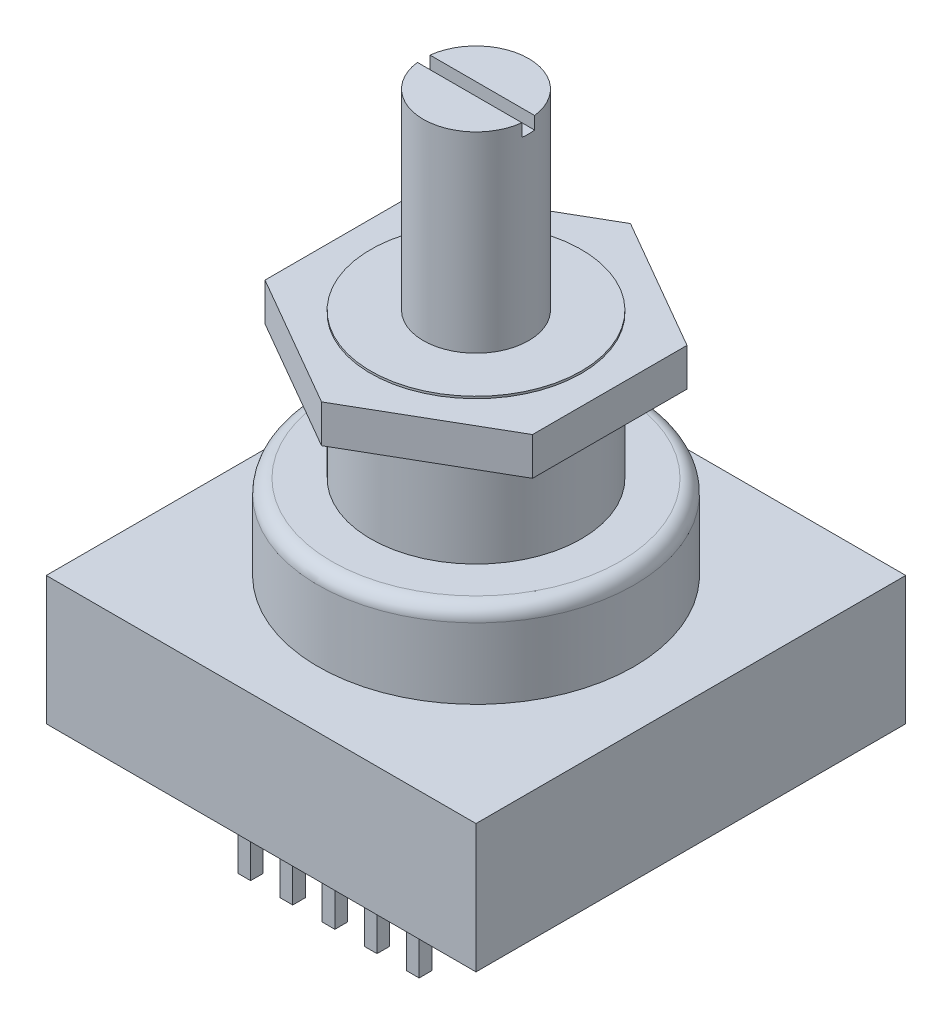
ISO-10303-21;
HEADER;
FILE_DESCRIPTION(('STEP AP214'),'2;1');
FILE_NAME('part.step','',(''),(''),'','','');
FILE_SCHEMA(('AUTOMOTIVE_DESIGN { 1 0 10303 214 1 1 1 1 }'));
ENDSEC;
DATA;
#1=APPLICATION_CONTEXT('core data for automotive mechanical design processes');
#2=APPLICATION_PROTOCOL_DEFINITION('international standard','automotive_design',2000,#1);
#3=PRODUCT_CONTEXT('',#1,'mechanical');
#4=PRODUCT('Part','Part','',(#3));
#5=PRODUCT_RELATED_PRODUCT_CATEGORY('part','',(#4));
#6=PRODUCT_DEFINITION_FORMATION('','',#4);
#7=PRODUCT_DEFINITION_CONTEXT('part definition',#1,'design');
#8=PRODUCT_DEFINITION('design','',#6,#7);
#9=PRODUCT_DEFINITION_SHAPE('','',#8);
#10=(LENGTH_UNIT() NAMED_UNIT(*) SI_UNIT(.MILLI.,.METRE.));
#11=(NAMED_UNIT(*) PLANE_ANGLE_UNIT() SI_UNIT($,.RADIAN.));
#12=(NAMED_UNIT(*) SI_UNIT($,.STERADIAN.) SOLID_ANGLE_UNIT());
#13=UNCERTAINTY_MEASURE_WITH_UNIT(LENGTH_MEASURE(1.E-05),#10,'distance_accuracy_value','');
#14=(GEOMETRIC_REPRESENTATION_CONTEXT(3) GLOBAL_UNCERTAINTY_ASSIGNED_CONTEXT((#13)) GLOBAL_UNIT_ASSIGNED_CONTEXT((#10,
#11,#12)) REPRESENTATION_CONTEXT('',''));
#15=CARTESIAN_POINT('',(0.,0.,0.));
#16=DIRECTION('',(0.,0.,1.));
#17=DIRECTION('',(1.,0.,0.));
#18=AXIS2_PLACEMENT_3D('',#15,#16,#17);
#19=CARTESIAN_POINT('',(-8.0645,21.463,4.65604124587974));
#20=DIRECTION('',(0.5,0.,-0.866025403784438));
#21=DIRECTION('',(-0.866025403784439,0.,-0.5));
#22=AXIS2_PLACEMENT_3D('',#19,#20,#21);
#23=PLANE('',#22);
#24=DIRECTION('',(0.866025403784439,0.,0.5));
#25=VECTOR('',#24,1.);
#26=CARTESIAN_POINT('',(-8.0645,19.177,4.65604124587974));
#27=LINE('',#26,#25);
#28=CARTESIAN_POINT('',(-8.0645,19.177,4.65604124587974));
#29=VERTEX_POINT('',#28);
#30=CARTESIAN_POINT('',(0.,19.177,9.31208249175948));
#31=VERTEX_POINT('',#30);
#32=EDGE_CURVE('E129',#29,#31,#27,.T.);
#33=ORIENTED_EDGE('',*,*,#32,.T.);
#34=DIRECTION('',(0.,-1.,0.));
#35=VECTOR('',#34,1.);
#36=CARTESIAN_POINT('',(0.,21.463,9.31208249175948));
#37=LINE('',#36,#35);
#38=CARTESIAN_POINT('',(0.,21.463,9.31208249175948));
#39=VERTEX_POINT('',#38);
#40=EDGE_CURVE('E12',#39,#31,#37,.T.);
#41=ORIENTED_EDGE('',*,*,#40,.F.);
#42=DIRECTION('',(0.866025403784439,0.,0.5));
#43=VECTOR('',#42,1.);
#44=CARTESIAN_POINT('',(-8.0645,21.463,4.65604124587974));
#45=LINE('',#44,#43);
#46=CARTESIAN_POINT('',(-8.0645,21.463,4.65604124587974));
#47=VERTEX_POINT('',#46);
#48=EDGE_CURVE('E139',#47,#39,#45,.T.);
#49=ORIENTED_EDGE('',*,*,#48,.F.);
#50=DIRECTION('',(0.,-1.,0.));
#51=VECTOR('',#50,1.);
#52=CARTESIAN_POINT('',(-8.0645,21.463,4.65604124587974));
#53=LINE('',#52,#51);
#54=EDGE_CURVE('E125',#47,#29,#53,.T.);
#55=ORIENTED_EDGE('',*,*,#54,.T.);
#56=EDGE_LOOP('',(#33,#41,#49,#55));
#57=FACE_BOUND('',#56,.T.);
#58=ADVANCED_FACE('F45',(#57),#23,.F.);
#59=CARTESIAN_POINT('',(0.,21.463,9.31208249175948));
#60=DIRECTION('',(-0.5,0.,-0.866025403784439));
#61=DIRECTION('',(-0.866025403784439,0.,0.5));
#62=AXIS2_PLACEMENT_3D('',#59,#60,#61);
#63=PLANE('',#62);
#64=DIRECTION('',(0.866025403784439,0.,-0.5));
#65=VECTOR('',#64,1.);
#66=CARTESIAN_POINT('',(0.,19.177,9.31208249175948));
#67=LINE('',#66,#65);
#68=CARTESIAN_POINT('',(8.0645,19.177,4.65604124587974));
#69=VERTEX_POINT('',#68);
#70=EDGE_CURVE('E132',#31,#69,#67,.T.);
#71=ORIENTED_EDGE('',*,*,#70,.T.);
#72=DIRECTION('',(0.,-1.,0.));
#73=VECTOR('',#72,1.);
#74=CARTESIAN_POINT('',(8.0645,21.463,4.65604124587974));
#75=LINE('',#74,#73);
#76=CARTESIAN_POINT('',(8.0645,21.463,4.65604124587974));
#77=VERTEX_POINT('',#76);
#78=EDGE_CURVE('E53',#77,#69,#75,.T.);
#79=ORIENTED_EDGE('',*,*,#78,.F.);
#80=DIRECTION('',(0.866025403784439,0.,-0.5));
#81=VECTOR('',#80,1.);
#82=CARTESIAN_POINT('',(0.,21.463,9.31208249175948));
#83=LINE('',#82,#81);
#84=EDGE_CURVE('E98',#39,#77,#83,.T.);
#85=ORIENTED_EDGE('',*,*,#84,.F.);
#86=ORIENTED_EDGE('',*,*,#40,.T.);
#87=EDGE_LOOP('',(#71,#79,#85,#86));
#88=FACE_BOUND('',#87,.T.);
#89=ADVANCED_FACE('F163',(#88),#63,.F.);
#90=CARTESIAN_POINT('',(8.0645,21.463,4.65604124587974));
#91=DIRECTION('',(-1.,0.,0.));
#92=DIRECTION('',(0.,-1.,0.));
#93=AXIS2_PLACEMENT_3D('',#90,#91,#92);
#94=PLANE('',#93);
#95=DIRECTION('',(0.,0.,-1.));
#96=VECTOR('',#95,1.);
#97=CARTESIAN_POINT('',(8.0645,19.177,4.65604124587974));
#98=LINE('',#97,#96);
#99=CARTESIAN_POINT('',(8.0645,19.177,-4.65604124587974));
#100=VERTEX_POINT('',#99);
#101=EDGE_CURVE('E134',#69,#100,#98,.T.);
#102=ORIENTED_EDGE('',*,*,#101,.T.);
#103=DIRECTION('',(0.,-1.,0.));
#104=VECTOR('',#103,1.);
#105=CARTESIAN_POINT('',(8.0645,21.463,-4.65604124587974));
#106=LINE('',#105,#104);
#107=CARTESIAN_POINT('',(8.0645,21.463,-4.65604124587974));
#108=VERTEX_POINT('',#107);
#109=EDGE_CURVE('E120',#108,#100,#106,.T.);
#110=ORIENTED_EDGE('',*,*,#109,.F.);
#111=DIRECTION('',(0.,0.,-1.));
#112=VECTOR('',#111,1.);
#113=CARTESIAN_POINT('',(8.0645,21.463,4.65604124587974));
#114=LINE('',#113,#112);
#115=EDGE_CURVE('E111',#77,#108,#114,.T.);
#116=ORIENTED_EDGE('',*,*,#115,.F.);
#117=ORIENTED_EDGE('',*,*,#78,.T.);
#118=EDGE_LOOP('',(#102,#110,#116,#117));
#119=FACE_BOUND('',#118,.T.);
#120=ADVANCED_FACE('F145',(#119),#94,.F.);
#121=CARTESIAN_POINT('',(8.0645,21.463,-4.65604124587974));
#122=DIRECTION('',(-0.5,0.,0.866025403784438));
#123=DIRECTION('',(0.866025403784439,0.,0.5));
#124=AXIS2_PLACEMENT_3D('',#121,#122,#123);
#125=PLANE('',#124);
#126=DIRECTION('',(-0.866025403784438,0.,-0.5));
#127=VECTOR('',#126,1.);
#128=CARTESIAN_POINT('',(8.0645,19.177,-4.65604124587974));
#129=LINE('',#128,#127);
#130=CARTESIAN_POINT('',(0.,19.177,-9.31208249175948));
#131=VERTEX_POINT('',#130);
#132=EDGE_CURVE('E119',#100,#131,#129,.T.);
#133=ORIENTED_EDGE('',*,*,#132,.T.);
#134=DIRECTION('',(0.,-1.,0.));
#135=VECTOR('',#134,1.);
#136=CARTESIAN_POINT('',(0.,21.463,-9.31208249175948));
#137=LINE('',#136,#135);
#138=CARTESIAN_POINT('',(0.,21.463,-9.31208249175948));
#139=VERTEX_POINT('',#138);
#140=EDGE_CURVE('E116',#139,#131,#137,.T.);
#141=ORIENTED_EDGE('',*,*,#140,.F.);
#142=DIRECTION('',(-0.866025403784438,0.,-0.5));
#143=VECTOR('',#142,1.);
#144=CARTESIAN_POINT('',(8.0645,21.463,-4.65604124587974));
#145=LINE('',#144,#143);
#146=EDGE_CURVE('E105',#108,#139,#145,.T.);
#147=ORIENTED_EDGE('',*,*,#146,.F.);
#148=ORIENTED_EDGE('',*,*,#109,.T.);
#149=EDGE_LOOP('',(#133,#141,#147,#148));
#150=FACE_BOUND('',#149,.T.);
#151=ADVANCED_FACE('F117',(#150),#125,.F.);
#152=CARTESIAN_POINT('',(0.,21.463,-9.31208249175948));
#153=DIRECTION('',(0.5,0.,0.866025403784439));
#154=DIRECTION('',(0.866025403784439,0.,-0.5));
#155=AXIS2_PLACEMENT_3D('',#152,#153,#154);
#156=PLANE('',#155);
#157=DIRECTION('',(-0.866025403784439,0.,0.5));
#158=VECTOR('',#157,1.);
#159=CARTESIAN_POINT('',(0.,19.177,-9.31208249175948));
#160=LINE('',#159,#158);
#161=CARTESIAN_POINT('',(-8.0645,19.177,-4.65604124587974));
#162=VERTEX_POINT('',#161);
#163=EDGE_CURVE('E84',#131,#162,#160,.T.);
#164=ORIENTED_EDGE('',*,*,#163,.T.);
#165=DIRECTION('',(0.,-1.,0.));
#166=VECTOR('',#165,1.);
#167=CARTESIAN_POINT('',(-8.0645,21.463,-4.65604124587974));
#168=LINE('',#167,#166);
#169=CARTESIAN_POINT('',(-8.0645,21.463,-4.65604124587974));
#170=VERTEX_POINT('',#169);
#171=EDGE_CURVE('E121',#170,#162,#168,.T.);
#172=ORIENTED_EDGE('',*,*,#171,.F.);
#173=DIRECTION('',(-0.866025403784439,0.,0.5));
#174=VECTOR('',#173,1.);
#175=CARTESIAN_POINT('',(0.,21.463,-9.31208249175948));
#176=LINE('',#175,#174);
#177=EDGE_CURVE('E109',#139,#170,#176,.T.);
#178=ORIENTED_EDGE('',*,*,#177,.F.);
#179=ORIENTED_EDGE('',*,*,#140,.T.);
#180=EDGE_LOOP('',(#164,#172,#178,#179));
#181=FACE_BOUND('',#180,.T.);
#182=ADVANCED_FACE('F123',(#181),#156,.F.);
#183=CARTESIAN_POINT('',(-8.0645,21.463,-4.65604124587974));
#184=DIRECTION('',(1.,0.,0.));
#185=DIRECTION('',(0.,0.,-1.));
#186=AXIS2_PLACEMENT_3D('',#183,#184,#185);
#187=PLANE('',#186);
#188=DIRECTION('',(0.,0.,1.));
#189=VECTOR('',#188,1.);
#190=CARTESIAN_POINT('',(-8.0645,19.177,-4.65604124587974));
#191=LINE('',#190,#189);
#192=EDGE_CURVE('E90',#162,#29,#191,.T.);
#193=ORIENTED_EDGE('',*,*,#192,.T.);
#194=ORIENTED_EDGE('',*,*,#54,.F.);
#195=DIRECTION('',(0.,0.,1.));
#196=VECTOR('',#195,1.);
#197=CARTESIAN_POINT('',(-8.0645,21.463,-4.65604124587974));
#198=LINE('',#197,#196);
#199=EDGE_CURVE('E61',#170,#47,#198,.T.);
#200=ORIENTED_EDGE('',*,*,#199,.F.);
#201=ORIENTED_EDGE('',*,*,#171,.T.);
#202=EDGE_LOOP('',(#193,#194,#200,#201));
#203=FACE_BOUND('',#202,.T.);
#204=ADVANCED_FACE('F152',(#203),#187,.F.);
#205=CARTESIAN_POINT('',(0.,21.463,9.31208249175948));
#206=DIRECTION('',(0.,1.,0.));
#207=DIRECTION('',(0.,0.,1.));
#208=AXIS2_PLACEMENT_3D('',#205,#206,#207);
#209=PLANE('',#208);
#210=ORIENTED_EDGE('',*,*,#48,.T.);
#211=ORIENTED_EDGE('',*,*,#84,.T.);
#212=ORIENTED_EDGE('',*,*,#115,.T.);
#213=ORIENTED_EDGE('',*,*,#146,.T.);
#214=ORIENTED_EDGE('',*,*,#177,.T.);
#215=ORIENTED_EDGE('',*,*,#199,.T.);
#216=EDGE_LOOP('',(#210,#211,#212,#213,#214,#215));
#217=FACE_BOUND('',#216,.T.);
#218=ADVANCED_FACE('F107',(#217),#209,.T.);
#219=CARTESIAN_POINT('',(0.,19.177,9.31208249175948));
#220=DIRECTION('',(0.,1.,0.));
#221=DIRECTION('',(0.,0.,1.));
#222=AXIS2_PLACEMENT_3D('',#219,#220,#221);
#223=PLANE('',#222);
#224=ORIENTED_EDGE('',*,*,#32,.F.);
#225=ORIENTED_EDGE('',*,*,#192,.F.);
#226=ORIENTED_EDGE('',*,*,#163,.F.);
#227=ORIENTED_EDGE('',*,*,#132,.F.);
#228=ORIENTED_EDGE('',*,*,#101,.F.);
#229=ORIENTED_EDGE('',*,*,#70,.F.);
#230=EDGE_LOOP('',(#224,#225,#226,#227,#228,#229));
#231=FACE_BOUND('',#230,.T.);
#232=ADVANCED_FACE('F148',(#231),#223,.F.);
#233=CLOSED_SHELL('',(#58,#89,#120,#151,#182,#204,#218,#232));
#234=MANIFOLD_SOLID_BREP('B2',#233);
#235=CARTESIAN_POINT('',(0.,33.147,0.));
#236=DIRECTION('',(0.,-1.,0.));
#237=DIRECTION('',(1.,0.,0.));
#238=AXIS2_PLACEMENT_3D('',#235,#236,#237);
#239=PLANE('',#238);
#240=CARTESIAN_POINT('',(0.,33.147,0.));
#241=DIRECTION('',(0.,-1.,0.));
#242=DIRECTION('',(1.,0.,0.));
#243=AXIS2_PLACEMENT_3D('',#240,#241,#242);
#244=CIRCLE('',#243,3.175);
#245=CARTESIAN_POINT('',(-3.15205710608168,33.147,-0.381));
#246=VERTEX_POINT('',#245);
#247=CARTESIAN_POINT('',(3.15205710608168,33.147,-0.381));
#248=VERTEX_POINT('',#247);
#249=EDGE_CURVE('E291',#246,#248,#244,.T.);
#250=ORIENTED_EDGE('',*,*,#249,.F.);
#251=DIRECTION('',(-1.,0.,0.));
#252=VECTOR('',#251,1.);
#253=CARTESIAN_POINT('',(-4.13004581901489,33.147,-0.381));
#254=LINE('',#253,#252);
#255=EDGE_CURVE('E284',#248,#246,#254,.T.);
#256=ORIENTED_EDGE('',*,*,#255,.F.);
#257=EDGE_LOOP('',(#250,#256));
#258=FACE_BOUND('',#257,.T.);
#259=ADVANCED_FACE('F230',(#258),#239,.F.);
#260=CARTESIAN_POINT('',(0.,7.747,0.));
#261=DIRECTION('',(0.,-1.,0.));
#262=DIRECTION('',(1.,0.,0.));
#263=AXIS2_PLACEMENT_3D('',#260,#261,#262);
#264=CYLINDRICAL_SURFACE('',#263,8.525);
#265=CARTESIAN_POINT('',(0.,7.747,0.));
#266=DIRECTION('',(0.,-1.,0.));
#267=DIRECTION('',(1.,0.,0.));
#268=AXIS2_PLACEMENT_3D('',#265,#266,#267);
#269=CIRCLE('',#268,8.525);
#270=CARTESIAN_POINT('',(8.525,7.747,0.));
#271=VERTEX_POINT('',#270);
#272=EDGE_CURVE('E318',#271,#271,#269,.T.);
#273=ORIENTED_EDGE('',*,*,#272,.T.);
#274=EDGE_LOOP('',(#273));
#275=FACE_BOUND('',#274,.T.);
#276=CARTESIAN_POINT('',(0.,11.827,0.));
#277=DIRECTION('',(0.,-1.,0.));
#278=DIRECTION('',(1.,0.,0.));
#279=AXIS2_PLACEMENT_3D('',#276,#277,#278);
#280=CIRCLE('',#279,8.525);
#281=CARTESIAN_POINT('',(8.525,11.827,0.));
#282=VERTEX_POINT('',#281);
#283=EDGE_CURVE('E308',#282,#282,#280,.T.);
#284=ORIENTED_EDGE('',*,*,#283,.F.);
#285=EDGE_LOOP('',(#284));
#286=FACE_BOUND('',#285,.T.);
#287=ADVANCED_FACE('F232',(#275,#286),#264,.F.);
#288=CARTESIAN_POINT('',(6.35,11.827,0.));
#289=DIRECTION('',(0.,-1.,0.));
#290=DIRECTION('',(1.,0.,0.));
#291=AXIS2_PLACEMENT_3D('',#288,#289,#290);
#292=PLANE('',#291);
#293=ORIENTED_EDGE('',*,*,#283,.T.);
#294=EDGE_LOOP('',(#293));
#295=FACE_BOUND('',#294,.T.);
#296=CARTESIAN_POINT('',(0.,11.827,0.));
#297=DIRECTION('',(0.,-1.,0.));
#298=DIRECTION('',(1.,0.,0.));
#299=AXIS2_PLACEMENT_3D('',#296,#297,#298);
#300=CIRCLE('',#299,5.35);
#301=CARTESIAN_POINT('',(5.35,11.827,0.));
#302=VERTEX_POINT('',#301);
#303=EDGE_CURVE('E305',#302,#302,#300,.T.);
#304=ORIENTED_EDGE('',*,*,#303,.F.);
#305=EDGE_LOOP('',(#304));
#306=FACE_BOUND('',#305,.T.);
#307=ADVANCED_FACE('F361',(#295,#306),#292,.T.);
#308=CARTESIAN_POINT('',(0.,7.747,0.));
#309=DIRECTION('',(0.,-1.,0.));
#310=DIRECTION('',(1.,0.,0.));
#311=AXIS2_PLACEMENT_3D('',#308,#309,#310);
#312=CYLINDRICAL_SURFACE('',#311,5.35);
#313=ORIENTED_EDGE('',*,*,#303,.T.);
#314=EDGE_LOOP('',(#313));
#315=FACE_BOUND('',#314,.T.);
#316=CARTESIAN_POINT('',(0.,20.59,0.));
#317=DIRECTION('',(0.,-1.,0.));
#318=DIRECTION('',(1.,0.,0.));
#319=AXIS2_PLACEMENT_3D('',#316,#317,#318);
#320=CIRCLE('',#319,5.35);
#321=CARTESIAN_POINT('',(5.35,20.59,0.));
#322=VERTEX_POINT('',#321);
#323=EDGE_CURVE('E302',#322,#322,#320,.T.);
#324=ORIENTED_EDGE('',*,*,#323,.F.);
#325=EDGE_LOOP('',(#324));
#326=FACE_BOUND('',#325,.T.);
#327=ADVANCED_FACE('F374',(#315,#326),#312,.F.);
#328=CARTESIAN_POINT('',(3.175,20.59,0.));
#329=DIRECTION('',(0.,-1.,0.));
#330=DIRECTION('',(1.,0.,0.));
#331=AXIS2_PLACEMENT_3D('',#328,#329,#330);
#332=PLANE('',#331);
#333=ORIENTED_EDGE('',*,*,#323,.T.);
#334=EDGE_LOOP('',(#333));
#335=FACE_BOUND('',#334,.T.);
#336=CARTESIAN_POINT('',(0.,20.59,0.));
#337=DIRECTION('',(0.,-1.,0.));
#338=DIRECTION('',(1.,0.,0.));
#339=AXIS2_PLACEMENT_3D('',#336,#337,#338);
#340=CIRCLE('',#339,2.175);
#341=CARTESIAN_POINT('',(2.175,20.59,0.));
#342=VERTEX_POINT('',#341);
#343=EDGE_CURVE('E294',#342,#342,#340,.T.);
#344=ORIENTED_EDGE('',*,*,#343,.F.);
#345=EDGE_LOOP('',(#344));
#346=FACE_BOUND('',#345,.T.);
#347=ADVANCED_FACE('F370',(#335,#346),#332,.T.);
#348=CARTESIAN_POINT('',(0.,7.747,0.));
#349=DIRECTION('',(0.,-1.,0.));
#350=DIRECTION('',(1.,0.,0.));
#351=AXIS2_PLACEMENT_3D('',#348,#349,#350);
#352=CYLINDRICAL_SURFACE('',#351,2.175);
#353=ORIENTED_EDGE('',*,*,#343,.T.);
#354=EDGE_LOOP('',(#353));
#355=FACE_BOUND('',#354,.T.);
#356=CARTESIAN_POINT('',(0.,32.147,0.));
#357=DIRECTION('',(0.,-1.,0.));
#358=DIRECTION('',(1.,0.,0.));
#359=AXIS2_PLACEMENT_3D('',#356,#357,#358);
#360=CIRCLE('',#359,2.175);
#361=CARTESIAN_POINT('',(2.175,32.147,0.));
#362=VERTEX_POINT('',#361);
#363=EDGE_CURVE('E290',#362,#362,#360,.T.);
#364=ORIENTED_EDGE('',*,*,#363,.F.);
#365=EDGE_LOOP('',(#364));
#366=FACE_BOUND('',#365,.T.);
#367=ADVANCED_FACE('F366',(#355,#366),#352,.F.);
#368=CARTESIAN_POINT('',(0.,32.147,0.));
#369=DIRECTION('',(0.,-1.,0.));
#370=DIRECTION('',(1.,0.,0.));
#371=AXIS2_PLACEMENT_3D('',#368,#369,#370);
#372=PLANE('',#371);
#373=ORIENTED_EDGE('',*,*,#363,.T.);
#374=EDGE_LOOP('',(#373));
#375=FACE_BOUND('',#374,.T.);
#376=ADVANCED_FACE('F355',(#375),#372,.T.);
#377=CARTESIAN_POINT('',(3.15205710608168,33.147,0.381));
#378=VERTEX_POINT('',#377);
#379=CARTESIAN_POINT('',(-3.15205710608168,33.147,0.381));
#380=VERTEX_POINT('',#379);
#381=EDGE_CURVE('E283',#378,#380,#244,.T.);
#382=ORIENTED_EDGE('',*,*,#381,.F.);
#383=DIRECTION('',(1.,0.,0.));
#384=VECTOR('',#383,1.);
#385=CARTESIAN_POINT('',(-4.13004581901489,33.147,0.381));
#386=LINE('',#385,#384);
#387=EDGE_CURVE('E272',#380,#378,#386,.T.);
#388=ORIENTED_EDGE('',*,*,#387,.F.);
#389=EDGE_LOOP('',(#382,#388));
#390=FACE_BOUND('',#389,.T.);
#391=ADVANCED_FACE('F282',(#390),#239,.F.);
#392=CARTESIAN_POINT('',(0.,7.747,0.));
#393=DIRECTION('',(0.,-1.,0.));
#394=DIRECTION('',(1.,0.,0.));
#395=AXIS2_PLACEMENT_3D('',#392,#393,#394);
#396=CYLINDRICAL_SURFACE('',#395,3.175);
#397=ORIENTED_EDGE('',*,*,#249,.T.);
#398=DIRECTION('',(0.,-1.,0.));
#399=VECTOR('',#398,1.);
#400=CARTESIAN_POINT('',(3.15205710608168,7.747,-0.381));
#401=LINE('',#400,#399);
#402=CARTESIAN_POINT('',(3.15205710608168,32.385,-0.381));
#403=VERTEX_POINT('',#402);
#404=EDGE_CURVE('E43',#248,#403,#401,.T.);
#405=ORIENTED_EDGE('',*,*,#404,.T.);
#406=CARTESIAN_POINT('',(0.,32.385,0.));
#407=DIRECTION('',(0.,1.,0.));
#408=DIRECTION('',(0.,0.,1.));
#409=AXIS2_PLACEMENT_3D('',#406,#407,#408);
#410=CIRCLE('',#409,3.175);
#411=CARTESIAN_POINT('',(3.15205710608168,32.385,0.381));
#412=VERTEX_POINT('',#411);
#413=EDGE_CURVE('E311',#412,#403,#410,.T.);
#414=ORIENTED_EDGE('',*,*,#413,.F.);
#415=DIRECTION('',(0.,-1.,0.));
#416=VECTOR('',#415,1.);
#417=CARTESIAN_POINT('',(3.15205710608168,7.747,0.381));
#418=LINE('',#417,#416);
#419=EDGE_CURVE('E238',#412,#378,#418,.F.);
#420=ORIENTED_EDGE('',*,*,#419,.T.);
#421=ORIENTED_EDGE('',*,*,#381,.T.);
#422=DIRECTION('',(0.,-1.,0.));
#423=VECTOR('',#422,1.);
#424=CARTESIAN_POINT('',(-3.15205710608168,7.747,0.381));
#425=LINE('',#424,#423);
#426=CARTESIAN_POINT('',(-3.15205710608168,32.385,0.381));
#427=VERTEX_POINT('',#426);
#428=EDGE_CURVE('E269',#380,#427,#425,.T.);
#429=ORIENTED_EDGE('',*,*,#428,.T.);
#430=CARTESIAN_POINT('',(-3.15205710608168,32.385,-0.381));
#431=VERTEX_POINT('',#430);
#432=EDGE_CURVE('E278',#431,#427,#410,.T.);
#433=ORIENTED_EDGE('',*,*,#432,.F.);
#434=DIRECTION('',(0.,-1.,0.));
#435=VECTOR('',#434,1.);
#436=CARTESIAN_POINT('',(-3.15205710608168,7.747,-0.381));
#437=LINE('',#436,#435);
#438=EDGE_CURVE('E277',#431,#246,#437,.F.);
#439=ORIENTED_EDGE('',*,*,#438,.T.);
#440=EDGE_LOOP('',(#397,#405,#414,#420,#421,#429,#433,#439));
#441=FACE_BOUND('',#440,.T.);
#442=CARTESIAN_POINT('',(0.,21.59,0.));
#443=DIRECTION('',(0.,-1.,0.));
#444=DIRECTION('',(1.,0.,0.));
#445=AXIS2_PLACEMENT_3D('',#442,#443,#444);
#446=CIRCLE('',#445,3.175);
#447=CARTESIAN_POINT('',(3.175,21.59,0.));
#448=VERTEX_POINT('',#447);
#449=EDGE_CURVE('E296',#448,#448,#446,.T.);
#450=ORIENTED_EDGE('',*,*,#449,.F.);
#451=EDGE_LOOP('',(#450));
#452=FACE_BOUND('',#451,.T.);
#453=ADVANCED_FACE('F287',(#441,#452),#396,.T.);
#454=CARTESIAN_POINT('',(3.175,21.59,0.));
#455=DIRECTION('',(0.,-1.,0.));
#456=DIRECTION('',(1.,0.,0.));
#457=AXIS2_PLACEMENT_3D('',#454,#455,#456);
#458=PLANE('',#457);
#459=CARTESIAN_POINT('',(0.,21.59,0.));
#460=DIRECTION('',(0.,-1.,0.));
#461=DIRECTION('',(1.,0.,0.));
#462=AXIS2_PLACEMENT_3D('',#459,#460,#461);
#463=CIRCLE('',#462,6.35);
#464=CARTESIAN_POINT('',(6.35,21.59,0.));
#465=VERTEX_POINT('',#464);
#466=EDGE_CURVE('E338',#465,#465,#463,.T.);
#467=ORIENTED_EDGE('',*,*,#466,.F.);
#468=EDGE_LOOP('',(#467));
#469=FACE_BOUND('',#468,.T.);
#470=ORIENTED_EDGE('',*,*,#449,.T.);
#471=EDGE_LOOP('',(#470));
#472=FACE_BOUND('',#471,.T.);
#473=ADVANCED_FACE('F345',(#469,#472),#458,.F.);
#474=CARTESIAN_POINT('',(0.,7.747,0.));
#475=DIRECTION('',(0.,-1.,0.));
#476=DIRECTION('',(1.,0.,0.));
#477=AXIS2_PLACEMENT_3D('',#474,#475,#476);
#478=CYLINDRICAL_SURFACE('',#477,6.35);
#479=CARTESIAN_POINT('',(0.,12.827,0.));
#480=DIRECTION('',(0.,-1.,0.));
#481=DIRECTION('',(1.,0.,0.));
#482=AXIS2_PLACEMENT_3D('',#479,#480,#481);
#483=CIRCLE('',#482,6.35);
#484=CARTESIAN_POINT('',(6.35,12.827,0.));
#485=VERTEX_POINT('',#484);
#486=EDGE_CURVE('E336',#485,#485,#483,.T.);
#487=ORIENTED_EDGE('',*,*,#486,.F.);
#488=EDGE_LOOP('',(#487));
#489=FACE_BOUND('',#488,.T.);
#490=ORIENTED_EDGE('',*,*,#466,.T.);
#491=EDGE_LOOP('',(#490));
#492=FACE_BOUND('',#491,.T.);
#493=ADVANCED_FACE('F352',(#489,#492),#478,.T.);
#494=CARTESIAN_POINT('',(6.35,12.827,0.));
#495=DIRECTION('',(0.,-1.,0.));
#496=DIRECTION('',(1.,0.,0.));
#497=AXIS2_PLACEMENT_3D('',#494,#495,#496);
#498=PLANE('',#497);
#499=CARTESIAN_POINT('',(0.,12.827,0.));
#500=DIRECTION('',(0.,-1.,0.));
#501=DIRECTION('',(1.,0.,0.));
#502=AXIS2_PLACEMENT_3D('',#499,#500,#501);
#503=CIRCLE('',#502,8.69949999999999);
#504=CARTESIAN_POINT('',(8.6995,12.827,0.));
#505=VERTEX_POINT('',#504);
#506=EDGE_CURVE('E333',#505,#505,#503,.T.);
#507=ORIENTED_EDGE('',*,*,#506,.F.);
#508=EDGE_LOOP('',(#507));
#509=FACE_BOUND('',#508,.T.);
#510=ORIENTED_EDGE('',*,*,#486,.T.);
#511=EDGE_LOOP('',(#510));
#512=FACE_BOUND('',#511,.T.);
#513=ADVANCED_FACE('F463',(#509,#512),#498,.F.);
#514=CARTESIAN_POINT('',(0.,12.0015,0.));
#515=DIRECTION('',(0.,-1.,0.));
#516=DIRECTION('',(1.,0.,0.));
#517=AXIS2_PLACEMENT_3D('',#514,#515,#516);
#518=TOROIDAL_SURFACE('',#517,8.6995,0.8255);
#519=CARTESIAN_POINT('',(0.,12.0015,0.));
#520=DIRECTION('',(0.,-1.,0.));
#521=DIRECTION('',(1.,0.,0.));
#522=AXIS2_PLACEMENT_3D('',#519,#520,#521);
#523=CIRCLE('',#522,9.525);
#524=CARTESIAN_POINT('',(9.525,12.0015,0.));
#525=VERTEX_POINT('',#524);
#526=EDGE_CURVE('E330',#525,#525,#523,.T.);
#527=ORIENTED_EDGE('',*,*,#526,.F.);
#528=EDGE_LOOP('',(#527));
#529=FACE_BOUND('',#528,.T.);
#530=ORIENTED_EDGE('',*,*,#506,.T.);
#531=EDGE_LOOP('',(#530));
#532=FACE_BOUND('',#531,.T.);
#533=ADVANCED_FACE('F459',(#529,#532),#518,.T.);
#534=CARTESIAN_POINT('',(0.,7.747,0.));
#535=DIRECTION('',(0.,-1.,0.));
#536=DIRECTION('',(1.,0.,0.));
#537=AXIS2_PLACEMENT_3D('',#534,#535,#536);
#538=CYLINDRICAL_SURFACE('',#537,9.525);
#539=CARTESIAN_POINT('',(0.,7.747,0.));
#540=DIRECTION('',(0.,-1.,0.));
#541=DIRECTION('',(1.,0.,0.));
#542=AXIS2_PLACEMENT_3D('',#539,#540,#541);
#543=CIRCLE('',#542,9.525);
#544=CARTESIAN_POINT('',(9.525,7.747,0.));
#545=VERTEX_POINT('',#544);
#546=EDGE_CURVE('E327',#545,#545,#543,.T.);
#547=ORIENTED_EDGE('',*,*,#546,.F.);
#548=EDGE_LOOP('',(#547));
#549=FACE_BOUND('',#548,.T.);
#550=ORIENTED_EDGE('',*,*,#526,.T.);
#551=EDGE_LOOP('',(#550));
#552=FACE_BOUND('',#551,.T.);
#553=ADVANCED_FACE('F455',(#549,#552),#538,.T.);
#554=CARTESIAN_POINT('',(9.525,7.747,0.));
#555=DIRECTION('',(0.,1.,0.));
#556=DIRECTION('',(-1.,0.,0.));
#557=AXIS2_PLACEMENT_3D('',#554,#555,#556);
#558=PLANE('',#557);
#559=ORIENTED_EDGE('',*,*,#272,.F.);
#560=EDGE_LOOP('',(#559));
#561=FACE_BOUND('',#560,.T.);
#562=ORIENTED_EDGE('',*,*,#546,.T.);
#563=EDGE_LOOP('',(#562));
#564=FACE_BOUND('',#563,.T.);
#565=ADVANCED_FACE('F432',(#561,#564),#558,.F.);
#566=CARTESIAN_POINT('',(-4.13004581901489,32.385,-0.381));
#567=DIRECTION('',(0.,0.,-1.));
#568=DIRECTION('',(-1.,0.,0.));
#569=AXIS2_PLACEMENT_3D('',#566,#567,#568);
#570=PLANE('',#569);
#571=ORIENTED_EDGE('',*,*,#255,.T.);
#572=ORIENTED_EDGE('',*,*,#438,.F.);
#573=DIRECTION('',(-1.,0.,0.));
#574=VECTOR('',#573,1.);
#575=CARTESIAN_POINT('',(-4.13004581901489,32.385,-0.381));
#576=LINE('',#575,#574);
#577=EDGE_CURVE('E245',#403,#431,#576,.T.);
#578=ORIENTED_EDGE('',*,*,#577,.F.);
#579=ORIENTED_EDGE('',*,*,#404,.F.);
#580=EDGE_LOOP('',(#571,#572,#578,#579));
#581=FACE_BOUND('',#580,.T.);
#582=ADVANCED_FACE('F316',(#581),#570,.F.);
#583=CARTESIAN_POINT('',(-4.13004581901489,32.385,0.381));
#584=DIRECTION('',(0.,0.,1.));
#585=DIRECTION('',(1.,0.,0.));
#586=AXIS2_PLACEMENT_3D('',#583,#584,#585);
#587=PLANE('',#586);
#588=ORIENTED_EDGE('',*,*,#387,.T.);
#589=ORIENTED_EDGE('',*,*,#419,.F.);
#590=DIRECTION('',(1.,0.,0.));
#591=VECTOR('',#590,1.);
#592=CARTESIAN_POINT('',(-4.13004581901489,32.385,0.381));
#593=LINE('',#592,#591);
#594=EDGE_CURVE('E273',#427,#412,#593,.T.);
#595=ORIENTED_EDGE('',*,*,#594,.F.);
#596=ORIENTED_EDGE('',*,*,#428,.F.);
#597=EDGE_LOOP('',(#588,#589,#595,#596));
#598=FACE_BOUND('',#597,.T.);
#599=ADVANCED_FACE('F271',(#598),#587,.F.);
#600=CARTESIAN_POINT('',(-4.13004581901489,32.385,0.381));
#601=DIRECTION('',(0.,1.,0.));
#602=DIRECTION('',(0.,0.,1.));
#603=AXIS2_PLACEMENT_3D('',#600,#601,#602);
#604=PLANE('',#603);
#605=ORIENTED_EDGE('',*,*,#413,.T.);
#606=ORIENTED_EDGE('',*,*,#577,.T.);
#607=ORIENTED_EDGE('',*,*,#432,.T.);
#608=ORIENTED_EDGE('',*,*,#594,.T.);
#609=EDGE_LOOP('',(#605,#606,#607,#608));
#610=FACE_BOUND('',#609,.T.);
#611=ADVANCED_FACE('F314',(#610),#604,.T.);
#612=CLOSED_SHELL('',(#259,#287,#307,#327,#347,#367,#376,#391,#453,#473,#493,#513,#533,#553,
#565,#582,#599,#611));
#613=MANIFOLD_SOLID_BREP('B6',#612);
#614=CARTESIAN_POINT('',(-5.461,-6.096,8.88999999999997));
#615=DIRECTION('',(0.,0.,-1.));
#616=DIRECTION('',(-1.,0.,0.));
#617=AXIS2_PLACEMENT_3D('',#614,#615,#616);
#618=PLANE('',#617);
#619=DIRECTION('',(-1.,0.,0.));
#620=VECTOR('',#619,1.);
#621=CARTESIAN_POINT('',(-5.461,0.,8.88999999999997));
#622=LINE('',#621,#620);
#623=CARTESIAN_POINT('',(-4.699,0.,8.88999999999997));
#624=VERTEX_POINT('',#623);
#625=CARTESIAN_POINT('',(-5.461,0.,8.88999999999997));
#626=VERTEX_POINT('',#625);
#627=EDGE_CURVE('E603',#624,#626,#622,.T.);
#628=ORIENTED_EDGE('',*,*,#627,.T.);
#629=DIRECTION('',(0.,1.,0.));
#630=VECTOR('',#629,1.);
#631=CARTESIAN_POINT('',(-5.461,-6.096,8.88999999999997));
#632=LINE('',#631,#630);
#633=CARTESIAN_POINT('',(-5.461,-6.096,8.88999999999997));
#634=VERTEX_POINT('',#633);
#635=EDGE_CURVE('E228',#634,#626,#632,.T.);
#636=ORIENTED_EDGE('',*,*,#635,.F.);
#637=DIRECTION('',(-1.,0.,0.));
#638=VECTOR('',#637,1.);
#639=CARTESIAN_POINT('',(-5.461,-6.096,8.88999999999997));
#640=LINE('',#639,#638);
#641=CARTESIAN_POINT('',(-4.699,-6.096,8.88999999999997));
#642=VERTEX_POINT('',#641);
#643=EDGE_CURVE('E591',#642,#634,#640,.T.);
#644=ORIENTED_EDGE('',*,*,#643,.F.);
#645=DIRECTION('',(0.,1.,0.));
#646=VECTOR('',#645,1.);
#647=CARTESIAN_POINT('',(-4.699,-6.096,8.88999999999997));
#648=LINE('',#647,#646);
#649=EDGE_CURVE('E599',#642,#624,#648,.T.);
#650=ORIENTED_EDGE('',*,*,#649,.T.);
#651=EDGE_LOOP('',(#628,#636,#644,#650));
#652=FACE_BOUND('',#651,.T.);
#653=ADVANCED_FACE('F540',(#652),#618,.F.);
#654=CARTESIAN_POINT('',(-5.461,-6.096,8.88999999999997));
#655=DIRECTION('',(1.,0.,0.));
#656=DIRECTION('',(0.,0.,-1.));
#657=AXIS2_PLACEMENT_3D('',#654,#655,#656);
#658=PLANE('',#657);
#659=DIRECTION('',(0.,0.,-1.));
#660=VECTOR('',#659,1.);
#661=CARTESIAN_POINT('',(-5.461,0.,8.88999999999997));
#662=LINE('',#661,#660);
#663=CARTESIAN_POINT('',(-5.461,0.,8.12799999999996));
#664=VERTEX_POINT('',#663);
#665=EDGE_CURVE('E595',#626,#664,#662,.T.);
#666=ORIENTED_EDGE('',*,*,#665,.T.);
#667=DIRECTION('',(0.,1.,0.));
#668=VECTOR('',#667,1.);
#669=CARTESIAN_POINT('',(-5.461,-6.096,8.12799999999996));
#670=LINE('',#669,#668);
#671=CARTESIAN_POINT('',(-5.461,-6.096,8.12799999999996));
#672=VERTEX_POINT('',#671);
#673=EDGE_CURVE('E548',#672,#664,#670,.T.);
#674=ORIENTED_EDGE('',*,*,#673,.F.);
#675=DIRECTION('',(0.,0.,-1.));
#676=VECTOR('',#675,1.);
#677=CARTESIAN_POINT('',(-5.461,-6.096,8.88999999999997));
#678=LINE('',#677,#676);
#679=EDGE_CURVE('E586',#634,#672,#678,.T.);
#680=ORIENTED_EDGE('',*,*,#679,.F.);
#681=ORIENTED_EDGE('',*,*,#635,.T.);
#682=EDGE_LOOP('',(#666,#674,#680,#681));
#683=FACE_BOUND('',#682,.T.);
#684=ADVANCED_FACE('F594',(#683),#658,.F.);
#685=CARTESIAN_POINT('',(-5.461,-6.096,8.12799999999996));
#686=DIRECTION('',(0.,0.,1.));
#687=DIRECTION('',(1.,0.,0.));
#688=AXIS2_PLACEMENT_3D('',#685,#686,#687);
#689=PLANE('',#688);
#690=DIRECTION('',(1.,0.,0.));
#691=VECTOR('',#690,1.);
#692=CARTESIAN_POINT('',(-5.461,0.,8.12799999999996));
#693=LINE('',#692,#691);
#694=CARTESIAN_POINT('',(-4.699,0.,8.12799999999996));
#695=VERTEX_POINT('',#694);
#696=EDGE_CURVE('E573',#664,#695,#693,.T.);
#697=ORIENTED_EDGE('',*,*,#696,.T.);
#698=DIRECTION('',(0.,1.,0.));
#699=VECTOR('',#698,1.);
#700=CARTESIAN_POINT('',(-4.699,-6.096,8.12799999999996));
#701=LINE('',#700,#699);
#702=CARTESIAN_POINT('',(-4.699,-6.096,8.12799999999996));
#703=VERTEX_POINT('',#702);
#704=EDGE_CURVE('E596',#703,#695,#701,.T.);
#705=ORIENTED_EDGE('',*,*,#704,.F.);
#706=DIRECTION('',(1.,0.,0.));
#707=VECTOR('',#706,1.);
#708=CARTESIAN_POINT('',(-5.461,-6.096,8.12799999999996));
#709=LINE('',#708,#707);
#710=EDGE_CURVE('E589',#672,#703,#709,.T.);
#711=ORIENTED_EDGE('',*,*,#710,.F.);
#712=ORIENTED_EDGE('',*,*,#673,.T.);
#713=EDGE_LOOP('',(#697,#705,#711,#712));
#714=FACE_BOUND('',#713,.T.);
#715=ADVANCED_FACE('F597',(#714),#689,.F.);
#716=CARTESIAN_POINT('',(-4.699,-6.096,8.88999999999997));
#717=DIRECTION('',(-1.,0.,0.));
#718=DIRECTION('',(0.,0.,1.));
#719=AXIS2_PLACEMENT_3D('',#716,#717,#718);
#720=PLANE('',#719);
#721=DIRECTION('',(0.,0.,1.));
#722=VECTOR('',#721,1.);
#723=CARTESIAN_POINT('',(-4.699,0.,8.88999999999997));
#724=LINE('',#723,#722);
#725=EDGE_CURVE('E579',#695,#624,#724,.T.);
#726=ORIENTED_EDGE('',*,*,#725,.T.);
#727=ORIENTED_EDGE('',*,*,#649,.F.);
#728=DIRECTION('',(0.,0.,1.));
#729=VECTOR('',#728,1.);
#730=CARTESIAN_POINT('',(-4.699,-6.096,8.88999999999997));
#731=LINE('',#730,#729);
#732=EDGE_CURVE('E556',#703,#642,#731,.T.);
#733=ORIENTED_EDGE('',*,*,#732,.F.);
#734=ORIENTED_EDGE('',*,*,#704,.T.);
#735=EDGE_LOOP('',(#726,#727,#733,#734));
#736=FACE_BOUND('',#735,.T.);
#737=ADVANCED_FACE('F610',(#736),#720,.F.);
#738=CARTESIAN_POINT('',(-5.461,-6.096,8.88999999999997));
#739=DIRECTION('',(0.,1.,0.));
#740=DIRECTION('',(0.,0.,1.));
#741=AXIS2_PLACEMENT_3D('',#738,#739,#740);
#742=PLANE('',#741);
#743=ORIENTED_EDGE('',*,*,#643,.T.);
#744=ORIENTED_EDGE('',*,*,#679,.T.);
#745=ORIENTED_EDGE('',*,*,#710,.T.);
#746=ORIENTED_EDGE('',*,*,#732,.T.);
#747=EDGE_LOOP('',(#743,#744,#745,#746));
#748=FACE_BOUND('',#747,.T.);
#749=ADVANCED_FACE('F587',(#748),#742,.F.);
#750=CARTESIAN_POINT('',(-5.461,0.,8.88999999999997));
#751=DIRECTION('',(0.,1.,0.));
#752=DIRECTION('',(0.,0.,1.));
#753=AXIS2_PLACEMENT_3D('',#750,#751,#752);
#754=PLANE('',#753);
#755=ORIENTED_EDGE('',*,*,#627,.F.);
#756=ORIENTED_EDGE('',*,*,#725,.F.);
#757=ORIENTED_EDGE('',*,*,#696,.F.);
#758=ORIENTED_EDGE('',*,*,#665,.F.);
#759=EDGE_LOOP('',(#755,#756,#757,#758));
#760=FACE_BOUND('',#759,.T.);
#761=ADVANCED_FACE('F613',(#760),#754,.T.);
#762=CLOSED_SHELL('',(#653,#684,#715,#737,#749,#761));
#763=MANIFOLD_SOLID_BREP('B37',#762);
#764=CARTESIAN_POINT('',(4.699,-6.096,8.89));
#765=DIRECTION('',(0.,0.,-1.));
#766=DIRECTION('',(-1.,0.,0.));
#767=AXIS2_PLACEMENT_3D('',#764,#765,#766);
#768=PLANE('',#767);
#769=DIRECTION('',(-1.,0.,0.));
#770=VECTOR('',#769,1.);
#771=CARTESIAN_POINT('',(4.699,0.,8.89));
#772=LINE('',#771,#770);
#773=CARTESIAN_POINT('',(5.461,0.,8.89));
#774=VERTEX_POINT('',#773);
#775=CARTESIAN_POINT('',(4.699,0.,8.89));
#776=VERTEX_POINT('',#775);
#777=EDGE_CURVE('E736',#774,#776,#772,.T.);
#778=ORIENTED_EDGE('',*,*,#777,.T.);
#779=DIRECTION('',(0.,1.,0.));
#780=VECTOR('',#779,1.);
#781=CARTESIAN_POINT('',(4.699,-6.096,8.89));
#782=LINE('',#781,#780);
#783=CARTESIAN_POINT('',(4.699,-6.096,8.89));
#784=VERTEX_POINT('',#783);
#785=EDGE_CURVE('E538',#784,#776,#782,.T.);
#786=ORIENTED_EDGE('',*,*,#785,.F.);
#787=DIRECTION('',(-1.,0.,0.));
#788=VECTOR('',#787,1.);
#789=CARTESIAN_POINT('',(4.699,-6.096,8.89));
#790=LINE('',#789,#788);
#791=CARTESIAN_POINT('',(5.461,-6.096,8.89));
#792=VERTEX_POINT('',#791);
#793=EDGE_CURVE('E724',#792,#784,#790,.T.);
#794=ORIENTED_EDGE('',*,*,#793,.F.);
#795=DIRECTION('',(0.,1.,0.));
#796=VECTOR('',#795,1.);
#797=CARTESIAN_POINT('',(5.461,-6.096,8.89));
#798=LINE('',#797,#796);
#799=EDGE_CURVE('E732',#792,#774,#798,.T.);
#800=ORIENTED_EDGE('',*,*,#799,.T.);
#801=EDGE_LOOP('',(#778,#786,#794,#800));
#802=FACE_BOUND('',#801,.T.);
#803=ADVANCED_FACE('F673',(#802),#768,.F.);
#804=CARTESIAN_POINT('',(4.699,-6.096,8.89));
#805=DIRECTION('',(1.,0.,0.));
#806=DIRECTION('',(0.,0.,-1.));
#807=AXIS2_PLACEMENT_3D('',#804,#805,#806);
#808=PLANE('',#807);
#809=DIRECTION('',(0.,0.,-1.));
#810=VECTOR('',#809,1.);
#811=CARTESIAN_POINT('',(4.699,0.,8.89));
#812=LINE('',#811,#810);
#813=CARTESIAN_POINT('',(4.699,0.,8.128));
#814=VERTEX_POINT('',#813);
#815=EDGE_CURVE('E728',#776,#814,#812,.T.);
#816=ORIENTED_EDGE('',*,*,#815,.T.);
#817=DIRECTION('',(0.,1.,0.));
#818=VECTOR('',#817,1.);
#819=CARTESIAN_POINT('',(4.699,-6.096,8.128));
#820=LINE('',#819,#818);
#821=CARTESIAN_POINT('',(4.699,-6.096,8.128));
#822=VERTEX_POINT('',#821);
#823=EDGE_CURVE('E681',#822,#814,#820,.T.);
#824=ORIENTED_EDGE('',*,*,#823,.F.);
#825=DIRECTION('',(0.,0.,-1.));
#826=VECTOR('',#825,1.);
#827=CARTESIAN_POINT('',(4.699,-6.096,8.89));
#828=LINE('',#827,#826);
#829=EDGE_CURVE('E719',#784,#822,#828,.T.);
#830=ORIENTED_EDGE('',*,*,#829,.F.);
#831=ORIENTED_EDGE('',*,*,#785,.T.);
#832=EDGE_LOOP('',(#816,#824,#830,#831));
#833=FACE_BOUND('',#832,.T.);
#834=ADVANCED_FACE('F727',(#833),#808,.F.);
#835=CARTESIAN_POINT('',(4.699,-6.096,8.128));
#836=DIRECTION('',(0.,0.,1.));
#837=DIRECTION('',(1.,0.,0.));
#838=AXIS2_PLACEMENT_3D('',#835,#836,#837);
#839=PLANE('',#838);
#840=DIRECTION('',(1.,0.,0.));
#841=VECTOR('',#840,1.);
#842=CARTESIAN_POINT('',(4.699,0.,8.128));
#843=LINE('',#842,#841);
#844=CARTESIAN_POINT('',(5.461,0.,8.128));
#845=VERTEX_POINT('',#844);
#846=EDGE_CURVE('E706',#814,#845,#843,.T.);
#847=ORIENTED_EDGE('',*,*,#846,.T.);
#848=DIRECTION('',(0.,1.,0.));
#849=VECTOR('',#848,1.);
#850=CARTESIAN_POINT('',(5.461,-6.096,8.128));
#851=LINE('',#850,#849);
#852=CARTESIAN_POINT('',(5.461,-6.096,8.128));
#853=VERTEX_POINT('',#852);
#854=EDGE_CURVE('E729',#853,#845,#851,.T.);
#855=ORIENTED_EDGE('',*,*,#854,.F.);
#856=DIRECTION('',(1.,0.,0.));
#857=VECTOR('',#856,1.);
#858=CARTESIAN_POINT('',(4.699,-6.096,8.128));
#859=LINE('',#858,#857);
#860=EDGE_CURVE('E722',#822,#853,#859,.T.);
#861=ORIENTED_EDGE('',*,*,#860,.F.);
#862=ORIENTED_EDGE('',*,*,#823,.T.);
#863=EDGE_LOOP('',(#847,#855,#861,#862));
#864=FACE_BOUND('',#863,.T.);
#865=ADVANCED_FACE('F730',(#864),#839,.F.);
#866=CARTESIAN_POINT('',(5.461,-6.096,8.89));
#867=DIRECTION('',(-1.,0.,0.));
#868=DIRECTION('',(0.,0.,1.));
#869=AXIS2_PLACEMENT_3D('',#866,#867,#868);
#870=PLANE('',#869);
#871=DIRECTION('',(0.,0.,1.));
#872=VECTOR('',#871,1.);
#873=CARTESIAN_POINT('',(5.461,0.,8.89));
#874=LINE('',#873,#872);
#875=EDGE_CURVE('E712',#845,#774,#874,.T.);
#876=ORIENTED_EDGE('',*,*,#875,.T.);
#877=ORIENTED_EDGE('',*,*,#799,.F.);
#878=DIRECTION('',(0.,0.,1.));
#879=VECTOR('',#878,1.);
#880=CARTESIAN_POINT('',(5.461,-6.096,8.89));
#881=LINE('',#880,#879);
#882=EDGE_CURVE('E689',#853,#792,#881,.T.);
#883=ORIENTED_EDGE('',*,*,#882,.F.);
#884=ORIENTED_EDGE('',*,*,#854,.T.);
#885=EDGE_LOOP('',(#876,#877,#883,#884));
#886=FACE_BOUND('',#885,.T.);
#887=ADVANCED_FACE('F743',(#886),#870,.F.);
#888=CARTESIAN_POINT('',(4.699,-6.096,8.89));
#889=DIRECTION('',(0.,1.,0.));
#890=DIRECTION('',(0.,0.,1.));
#891=AXIS2_PLACEMENT_3D('',#888,#889,#890);
#892=PLANE('',#891);
#893=ORIENTED_EDGE('',*,*,#793,.T.);
#894=ORIENTED_EDGE('',*,*,#829,.T.);
#895=ORIENTED_EDGE('',*,*,#860,.T.);
#896=ORIENTED_EDGE('',*,*,#882,.T.);
#897=EDGE_LOOP('',(#893,#894,#895,#896));
#898=FACE_BOUND('',#897,.T.);
#899=ADVANCED_FACE('F720',(#898),#892,.F.);
#900=CARTESIAN_POINT('',(4.699,0.,8.89));
#901=DIRECTION('',(0.,1.,0.));
#902=DIRECTION('',(0.,0.,1.));
#903=AXIS2_PLACEMENT_3D('',#900,#901,#902);
#904=PLANE('',#903);
#905=ORIENTED_EDGE('',*,*,#777,.F.);
#906=ORIENTED_EDGE('',*,*,#875,.F.);
#907=ORIENTED_EDGE('',*,*,#846,.F.);
#908=ORIENTED_EDGE('',*,*,#815,.F.);
#909=EDGE_LOOP('',(#905,#906,#907,#908));
#910=FACE_BOUND('',#909,.T.);
#911=ADVANCED_FACE('F746',(#910),#904,.T.);
#912=CLOSED_SHELL('',(#803,#834,#865,#887,#899,#911));
#913=MANIFOLD_SOLID_BREP('B222',#912);
#914=CARTESIAN_POINT('',(2.159,-6.096,8.89));
#915=DIRECTION('',(0.,0.,-1.));
#916=DIRECTION('',(-1.,0.,0.));
#917=AXIS2_PLACEMENT_3D('',#914,#915,#916);
#918=PLANE('',#917);
#919=DIRECTION('',(-1.,0.,0.));
#920=VECTOR('',#919,1.);
#921=CARTESIAN_POINT('',(2.159,0.,8.89));
#922=LINE('',#921,#920);
#923=CARTESIAN_POINT('',(2.921,0.,8.89));
#924=VERTEX_POINT('',#923);
#925=CARTESIAN_POINT('',(2.159,0.,8.89));
#926=VERTEX_POINT('',#925);
#927=EDGE_CURVE('E869',#924,#926,#922,.T.);
#928=ORIENTED_EDGE('',*,*,#927,.T.);
#929=DIRECTION('',(0.,1.,0.));
#930=VECTOR('',#929,1.);
#931=CARTESIAN_POINT('',(2.159,-6.096,8.89));
#932=LINE('',#931,#930);
#933=CARTESIAN_POINT('',(2.159,-6.096,8.89));
#934=VERTEX_POINT('',#933);
#935=EDGE_CURVE('E671',#934,#926,#932,.T.);
#936=ORIENTED_EDGE('',*,*,#935,.F.);
#937=DIRECTION('',(-1.,0.,0.));
#938=VECTOR('',#937,1.);
#939=CARTESIAN_POINT('',(2.159,-6.096,8.89));
#940=LINE('',#939,#938);
#941=CARTESIAN_POINT('',(2.921,-6.096,8.89));
#942=VERTEX_POINT('',#941);
#943=EDGE_CURVE('E857',#942,#934,#940,.T.);
#944=ORIENTED_EDGE('',*,*,#943,.F.);
#945=DIRECTION('',(0.,1.,0.));
#946=VECTOR('',#945,1.);
#947=CARTESIAN_POINT('',(2.921,-6.096,8.89));
#948=LINE('',#947,#946);
#949=EDGE_CURVE('E865',#942,#924,#948,.T.);
#950=ORIENTED_EDGE('',*,*,#949,.T.);
#951=EDGE_LOOP('',(#928,#936,#944,#950));
#952=FACE_BOUND('',#951,.T.);
#953=ADVANCED_FACE('F806',(#952),#918,.F.);
#954=CARTESIAN_POINT('',(2.159,-6.096,8.89));
#955=DIRECTION('',(1.,0.,0.));
#956=DIRECTION('',(0.,0.,-1.));
#957=AXIS2_PLACEMENT_3D('',#954,#955,#956);
#958=PLANE('',#957);
#959=DIRECTION('',(0.,0.,-1.));
#960=VECTOR('',#959,1.);
#961=CARTESIAN_POINT('',(2.159,0.,8.89));
#962=LINE('',#961,#960);
#963=CARTESIAN_POINT('',(2.159,0.,8.128));
#964=VERTEX_POINT('',#963);
#965=EDGE_CURVE('E861',#926,#964,#962,.T.);
#966=ORIENTED_EDGE('',*,*,#965,.T.);
#967=DIRECTION('',(0.,1.,0.));
#968=VECTOR('',#967,1.);
#969=CARTESIAN_POINT('',(2.159,-6.096,8.128));
#970=LINE('',#969,#968);
#971=CARTESIAN_POINT('',(2.159,-6.096,8.128));
#972=VERTEX_POINT('',#971);
#973=EDGE_CURVE('E814',#972,#964,#970,.T.);
#974=ORIENTED_EDGE('',*,*,#973,.F.);
#975=DIRECTION('',(0.,0.,-1.));
#976=VECTOR('',#975,1.);
#977=CARTESIAN_POINT('',(2.159,-6.096,8.89));
#978=LINE('',#977,#976);
#979=EDGE_CURVE('E852',#934,#972,#978,.T.);
#980=ORIENTED_EDGE('',*,*,#979,.F.);
#981=ORIENTED_EDGE('',*,*,#935,.T.);
#982=EDGE_LOOP('',(#966,#974,#980,#981));
#983=FACE_BOUND('',#982,.T.);
#984=ADVANCED_FACE('F860',(#983),#958,.F.);
#985=CARTESIAN_POINT('',(2.159,-6.096,8.128));
#986=DIRECTION('',(0.,0.,1.));
#987=DIRECTION('',(1.,0.,0.));
#988=AXIS2_PLACEMENT_3D('',#985,#986,#987);
#989=PLANE('',#988);
#990=DIRECTION('',(1.,0.,0.));
#991=VECTOR('',#990,1.);
#992=CARTESIAN_POINT('',(2.159,0.,8.128));
#993=LINE('',#992,#991);
#994=CARTESIAN_POINT('',(2.921,0.,8.128));
#995=VERTEX_POINT('',#994);
#996=EDGE_CURVE('E839',#964,#995,#993,.T.);
#997=ORIENTED_EDGE('',*,*,#996,.T.);
#998=DIRECTION('',(0.,1.,0.));
#999=VECTOR('',#998,1.);
#1000=CARTESIAN_POINT('',(2.921,-6.096,8.128));
#1001=LINE('',#1000,#999);
#1002=CARTESIAN_POINT('',(2.921,-6.096,8.128));
#1003=VERTEX_POINT('',#1002);
#1004=EDGE_CURVE('E862',#1003,#995,#1001,.T.);
#1005=ORIENTED_EDGE('',*,*,#1004,.F.);
#1006=DIRECTION('',(1.,0.,0.));
#1007=VECTOR('',#1006,1.);
#1008=CARTESIAN_POINT('',(2.159,-6.096,8.128));
#1009=LINE('',#1008,#1007);
#1010=EDGE_CURVE('E855',#972,#1003,#1009,.T.);
#1011=ORIENTED_EDGE('',*,*,#1010,.F.);
#1012=ORIENTED_EDGE('',*,*,#973,.T.);
#1013=EDGE_LOOP('',(#997,#1005,#1011,#1012));
#1014=FACE_BOUND('',#1013,.T.);
#1015=ADVANCED_FACE('F863',(#1014),#989,.F.);
#1016=CARTESIAN_POINT('',(2.921,-6.096,8.89));
#1017=DIRECTION('',(-1.,0.,0.));
#1018=DIRECTION('',(0.,0.,1.));
#1019=AXIS2_PLACEMENT_3D('',#1016,#1017,#1018);
#1020=PLANE('',#1019);
#1021=DIRECTION('',(0.,0.,1.));
#1022=VECTOR('',#1021,1.);
#1023=CARTESIAN_POINT('',(2.921,0.,8.89));
#1024=LINE('',#1023,#1022);
#1025=EDGE_CURVE('E845',#995,#924,#1024,.T.);
#1026=ORIENTED_EDGE('',*,*,#1025,.T.);
#1027=ORIENTED_EDGE('',*,*,#949,.F.);
#1028=DIRECTION('',(0.,0.,1.));
#1029=VECTOR('',#1028,1.);
#1030=CARTESIAN_POINT('',(2.921,-6.096,8.89));
#1031=LINE('',#1030,#1029);
#1032=EDGE_CURVE('E822',#1003,#942,#1031,.T.);
#1033=ORIENTED_EDGE('',*,*,#1032,.F.);
#1034=ORIENTED_EDGE('',*,*,#1004,.T.);
#1035=EDGE_LOOP('',(#1026,#1027,#1033,#1034));
#1036=FACE_BOUND('',#1035,.T.);
#1037=ADVANCED_FACE('F876',(#1036),#1020,.F.);
#1038=CARTESIAN_POINT('',(2.159,-6.096,8.89));
#1039=DIRECTION('',(0.,1.,0.));
#1040=DIRECTION('',(0.,0.,1.));
#1041=AXIS2_PLACEMENT_3D('',#1038,#1039,#1040);
#1042=PLANE('',#1041);
#1043=ORIENTED_EDGE('',*,*,#943,.T.);
#1044=ORIENTED_EDGE('',*,*,#979,.T.);
#1045=ORIENTED_EDGE('',*,*,#1010,.T.);
#1046=ORIENTED_EDGE('',*,*,#1032,.T.);
#1047=EDGE_LOOP('',(#1043,#1044,#1045,#1046));
#1048=FACE_BOUND('',#1047,.T.);
#1049=ADVANCED_FACE('F853',(#1048),#1042,.F.);
#1050=CARTESIAN_POINT('',(2.159,0.,8.89));
#1051=DIRECTION('',(0.,1.,0.));
#1052=DIRECTION('',(0.,0.,1.));
#1053=AXIS2_PLACEMENT_3D('',#1050,#1051,#1052);
#1054=PLANE('',#1053);
#1055=ORIENTED_EDGE('',*,*,#927,.F.);
#1056=ORIENTED_EDGE('',*,*,#1025,.F.);
#1057=ORIENTED_EDGE('',*,*,#996,.F.);
#1058=ORIENTED_EDGE('',*,*,#965,.F.);
#1059=EDGE_LOOP('',(#1055,#1056,#1057,#1058));
#1060=FACE_BOUND('',#1059,.T.);
#1061=ADVANCED_FACE('F879',(#1060),#1054,.T.);
#1062=CLOSED_SHELL('',(#953,#984,#1015,#1037,#1049,#1061));
#1063=MANIFOLD_SOLID_BREP('B532',#1062);
#1064=CARTESIAN_POINT('',(-2.921,-6.096,8.88999999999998));
#1065=DIRECTION('',(0.,0.,-1.));
#1066=DIRECTION('',(-1.,0.,0.));
#1067=AXIS2_PLACEMENT_3D('',#1064,#1065,#1066);
#1068=PLANE('',#1067);
#1069=DIRECTION('',(-1.,0.,0.));
#1070=VECTOR('',#1069,1.);
#1071=CARTESIAN_POINT('',(-2.921,0.,8.88999999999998));
#1072=LINE('',#1071,#1070);
#1073=CARTESIAN_POINT('',(-2.159,0.,8.88999999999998));
#1074=VERTEX_POINT('',#1073);
#1075=CARTESIAN_POINT('',(-2.921,0.,8.88999999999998));
#1076=VERTEX_POINT('',#1075);
#1077=EDGE_CURVE('E1002',#1074,#1076,#1072,.T.);
#1078=ORIENTED_EDGE('',*,*,#1077,.T.);
#1079=DIRECTION('',(0.,1.,0.));
#1080=VECTOR('',#1079,1.);
#1081=CARTESIAN_POINT('',(-2.921,-6.096,8.88999999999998));
#1082=LINE('',#1081,#1080);
#1083=CARTESIAN_POINT('',(-2.921,-6.096,8.88999999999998));
#1084=VERTEX_POINT('',#1083);
#1085=EDGE_CURVE('E804',#1084,#1076,#1082,.T.);
#1086=ORIENTED_EDGE('',*,*,#1085,.F.);
#1087=DIRECTION('',(-1.,0.,0.));
#1088=VECTOR('',#1087,1.);
#1089=CARTESIAN_POINT('',(-2.921,-6.096,8.88999999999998));
#1090=LINE('',#1089,#1088);
#1091=CARTESIAN_POINT('',(-2.159,-6.096,8.88999999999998));
#1092=VERTEX_POINT('',#1091);
#1093=EDGE_CURVE('E990',#1092,#1084,#1090,.T.);
#1094=ORIENTED_EDGE('',*,*,#1093,.F.);
#1095=DIRECTION('',(0.,1.,0.));
#1096=VECTOR('',#1095,1.);
#1097=CARTESIAN_POINT('',(-2.159,-6.096,8.88999999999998));
#1098=LINE('',#1097,#1096);
#1099=EDGE_CURVE('E998',#1092,#1074,#1098,.T.);
#1100=ORIENTED_EDGE('',*,*,#1099,.T.);
#1101=EDGE_LOOP('',(#1078,#1086,#1094,#1100));
#1102=FACE_BOUND('',#1101,.T.);
#1103=ADVANCED_FACE('F939',(#1102),#1068,.F.);
#1104=CARTESIAN_POINT('',(-2.921,-6.096,8.88999999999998));
#1105=DIRECTION('',(1.,0.,0.));
#1106=DIRECTION('',(0.,0.,-1.));
#1107=AXIS2_PLACEMENT_3D('',#1104,#1105,#1106);
#1108=PLANE('',#1107);
#1109=DIRECTION('',(0.,0.,-1.));
#1110=VECTOR('',#1109,1.);
#1111=CARTESIAN_POINT('',(-2.921,0.,8.88999999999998));
#1112=LINE('',#1111,#1110);
#1113=CARTESIAN_POINT('',(-2.921,0.,8.12799999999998));
#1114=VERTEX_POINT('',#1113);
#1115=EDGE_CURVE('E994',#1076,#1114,#1112,.T.);
#1116=ORIENTED_EDGE('',*,*,#1115,.T.);
#1117=DIRECTION('',(0.,1.,0.));
#1118=VECTOR('',#1117,1.);
#1119=CARTESIAN_POINT('',(-2.921,-6.096,8.12799999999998));
#1120=LINE('',#1119,#1118);
#1121=CARTESIAN_POINT('',(-2.921,-6.096,8.12799999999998));
#1122=VERTEX_POINT('',#1121);
#1123=EDGE_CURVE('E947',#1122,#1114,#1120,.T.);
#1124=ORIENTED_EDGE('',*,*,#1123,.F.);
#1125=DIRECTION('',(0.,0.,-1.));
#1126=VECTOR('',#1125,1.);
#1127=CARTESIAN_POINT('',(-2.921,-6.096,8.88999999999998));
#1128=LINE('',#1127,#1126);
#1129=EDGE_CURVE('E985',#1084,#1122,#1128,.T.);
#1130=ORIENTED_EDGE('',*,*,#1129,.F.);
#1131=ORIENTED_EDGE('',*,*,#1085,.T.);
#1132=EDGE_LOOP('',(#1116,#1124,#1130,#1131));
#1133=FACE_BOUND('',#1132,.T.);
#1134=ADVANCED_FACE('F993',(#1133),#1108,.F.);
#1135=CARTESIAN_POINT('',(-2.921,-6.096,8.12799999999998));
#1136=DIRECTION('',(0.,0.,1.));
#1137=DIRECTION('',(1.,0.,0.));
#1138=AXIS2_PLACEMENT_3D('',#1135,#1136,#1137);
#1139=PLANE('',#1138);
#1140=DIRECTION('',(1.,0.,0.));
#1141=VECTOR('',#1140,1.);
#1142=CARTESIAN_POINT('',(-2.921,0.,8.12799999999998));
#1143=LINE('',#1142,#1141);
#1144=CARTESIAN_POINT('',(-2.159,0.,8.12799999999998));
#1145=VERTEX_POINT('',#1144);
#1146=EDGE_CURVE('E972',#1114,#1145,#1143,.T.);
#1147=ORIENTED_EDGE('',*,*,#1146,.T.);
#1148=DIRECTION('',(0.,1.,0.));
#1149=VECTOR('',#1148,1.);
#1150=CARTESIAN_POINT('',(-2.159,-6.096,8.12799999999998));
#1151=LINE('',#1150,#1149);
#1152=CARTESIAN_POINT('',(-2.159,-6.096,8.12799999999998));
#1153=VERTEX_POINT('',#1152);
#1154=EDGE_CURVE('E995',#1153,#1145,#1151,.T.);
#1155=ORIENTED_EDGE('',*,*,#1154,.F.);
#1156=DIRECTION('',(1.,0.,0.));
#1157=VECTOR('',#1156,1.);
#1158=CARTESIAN_POINT('',(-2.921,-6.096,8.12799999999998));
#1159=LINE('',#1158,#1157);
#1160=EDGE_CURVE('E988',#1122,#1153,#1159,.T.);
#1161=ORIENTED_EDGE('',*,*,#1160,.F.);
#1162=ORIENTED_EDGE('',*,*,#1123,.T.);
#1163=EDGE_LOOP('',(#1147,#1155,#1161,#1162));
#1164=FACE_BOUND('',#1163,.T.);
#1165=ADVANCED_FACE('F996',(#1164),#1139,.F.);
#1166=CARTESIAN_POINT('',(-2.159,-6.096,8.88999999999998));
#1167=DIRECTION('',(-1.,0.,0.));
#1168=DIRECTION('',(0.,0.,1.));
#1169=AXIS2_PLACEMENT_3D('',#1166,#1167,#1168);
#1170=PLANE('',#1169);
#1171=DIRECTION('',(0.,0.,1.));
#1172=VECTOR('',#1171,1.);
#1173=CARTESIAN_POINT('',(-2.159,0.,8.88999999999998));
#1174=LINE('',#1173,#1172);
#1175=EDGE_CURVE('E978',#1145,#1074,#1174,.T.);
#1176=ORIENTED_EDGE('',*,*,#1175,.T.);
#1177=ORIENTED_EDGE('',*,*,#1099,.F.);
#1178=DIRECTION('',(0.,0.,1.));
#1179=VECTOR('',#1178,1.);
#1180=CARTESIAN_POINT('',(-2.159,-6.096,8.88999999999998));
#1181=LINE('',#1180,#1179);
#1182=EDGE_CURVE('E955',#1153,#1092,#1181,.T.);
#1183=ORIENTED_EDGE('',*,*,#1182,.F.);
#1184=ORIENTED_EDGE('',*,*,#1154,.T.);
#1185=EDGE_LOOP('',(#1176,#1177,#1183,#1184));
#1186=FACE_BOUND('',#1185,.T.);
#1187=ADVANCED_FACE('F1009',(#1186),#1170,.F.);
#1188=CARTESIAN_POINT('',(-2.921,-6.096,8.88999999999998));
#1189=DIRECTION('',(0.,1.,0.));
#1190=DIRECTION('',(0.,0.,1.));
#1191=AXIS2_PLACEMENT_3D('',#1188,#1189,#1190);
#1192=PLANE('',#1191);
#1193=ORIENTED_EDGE('',*,*,#1093,.T.);
#1194=ORIENTED_EDGE('',*,*,#1129,.T.);
#1195=ORIENTED_EDGE('',*,*,#1160,.T.);
#1196=ORIENTED_EDGE('',*,*,#1182,.T.);
#1197=EDGE_LOOP('',(#1193,#1194,#1195,#1196));
#1198=FACE_BOUND('',#1197,.T.);
#1199=ADVANCED_FACE('F986',(#1198),#1192,.F.);
#1200=CARTESIAN_POINT('',(-2.921,0.,8.88999999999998));
#1201=DIRECTION('',(0.,1.,0.));
#1202=DIRECTION('',(0.,0.,1.));
#1203=AXIS2_PLACEMENT_3D('',#1200,#1201,#1202);
#1204=PLANE('',#1203);
#1205=ORIENTED_EDGE('',*,*,#1077,.F.);
#1206=ORIENTED_EDGE('',*,*,#1175,.F.);
#1207=ORIENTED_EDGE('',*,*,#1146,.F.);
#1208=ORIENTED_EDGE('',*,*,#1115,.F.);
#1209=EDGE_LOOP('',(#1205,#1206,#1207,#1208));
#1210=FACE_BOUND('',#1209,.T.);
#1211=ADVANCED_FACE('F1012',(#1210),#1204,.T.);
#1212=CLOSED_SHELL('',(#1103,#1134,#1165,#1187,#1199,#1211));
#1213=MANIFOLD_SOLID_BREP('B665',#1212);
#1214=CARTESIAN_POINT('',(-0.380999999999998,-6.096,8.89));
#1215=DIRECTION('',(1.,0.,0.));
#1216=DIRECTION('',(0.,0.,-1.));
#1217=AXIS2_PLACEMENT_3D('',#1214,#1215,#1216);
#1218=PLANE('',#1217);
#1219=DIRECTION('',(0.,0.,-1.));
#1220=VECTOR('',#1219,1.);
#1221=CARTESIAN_POINT('',(-0.380999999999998,0.,8.89));
#1222=LINE('',#1221,#1220);
#1223=CARTESIAN_POINT('',(-0.380999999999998,0.,8.89));
#1224=VERTEX_POINT('',#1223);
#1225=CARTESIAN_POINT('',(-0.380999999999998,0.,8.128));
#1226=VERTEX_POINT('',#1225);
#1227=EDGE_CURVE('E1134',#1224,#1226,#1222,.T.);
#1228=ORIENTED_EDGE('',*,*,#1227,.T.);
#1229=DIRECTION('',(0.,1.,0.));
#1230=VECTOR('',#1229,1.);
#1231=CARTESIAN_POINT('',(-0.380999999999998,-6.096,8.128));
#1232=LINE('',#1231,#1230);
#1233=CARTESIAN_POINT('',(-0.380999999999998,-6.096,8.128));
#1234=VERTEX_POINT('',#1233);
#1235=EDGE_CURVE('E937',#1234,#1226,#1232,.T.);
#1236=ORIENTED_EDGE('',*,*,#1235,.F.);
#1237=DIRECTION('',(0.,0.,-1.));
#1238=VECTOR('',#1237,1.);
#1239=CARTESIAN_POINT('',(-0.380999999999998,-6.096,8.89));
#1240=LINE('',#1239,#1238);
#1241=CARTESIAN_POINT('',(-0.380999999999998,-6.096,8.89));
#1242=VERTEX_POINT('',#1241);
#1243=EDGE_CURVE('E1122',#1242,#1234,#1240,.T.);
#1244=ORIENTED_EDGE('',*,*,#1243,.F.);
#1245=DIRECTION('',(0.,1.,0.));
#1246=VECTOR('',#1245,1.);
#1247=CARTESIAN_POINT('',(-0.380999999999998,-6.096,8.89));
#1248=LINE('',#1247,#1246);
#1249=EDGE_CURVE('E1130',#1242,#1224,#1248,.T.);
#1250=ORIENTED_EDGE('',*,*,#1249,.T.);
#1251=EDGE_LOOP('',(#1228,#1236,#1244,#1250));
#1252=FACE_BOUND('',#1251,.T.);
#1253=ADVANCED_FACE('F1071',(#1252),#1218,.F.);
#1254=CARTESIAN_POINT('',(-0.380999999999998,-6.096,8.128));
#1255=DIRECTION('',(0.,0.,1.));
#1256=DIRECTION('',(1.,0.,0.));
#1257=AXIS2_PLACEMENT_3D('',#1254,#1255,#1256);
#1258=PLANE('',#1257);
#1259=DIRECTION('',(1.,0.,0.));
#1260=VECTOR('',#1259,1.);
#1261=CARTESIAN_POINT('',(-0.380999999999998,0.,8.128));
#1262=LINE('',#1261,#1260);
#1263=CARTESIAN_POINT('',(0.380999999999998,0.,8.128));
#1264=VERTEX_POINT('',#1263);
#1265=EDGE_CURVE('E1126',#1226,#1264,#1262,.T.);
#1266=ORIENTED_EDGE('',*,*,#1265,.T.);
#1267=DIRECTION('',(0.,1.,0.));
#1268=VECTOR('',#1267,1.);
#1269=CARTESIAN_POINT('',(0.380999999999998,-6.096,8.128));
#1270=LINE('',#1269,#1268);
#1271=CARTESIAN_POINT('',(0.380999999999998,-6.096,8.128));
#1272=VERTEX_POINT('',#1271);
#1273=EDGE_CURVE('E1079',#1272,#1264,#1270,.T.);
#1274=ORIENTED_EDGE('',*,*,#1273,.F.);
#1275=DIRECTION('',(1.,0.,0.));
#1276=VECTOR('',#1275,1.);
#1277=CARTESIAN_POINT('',(-0.380999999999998,-6.096,8.128));
#1278=LINE('',#1277,#1276);
#1279=EDGE_CURVE('E1117',#1234,#1272,#1278,.T.);
#1280=ORIENTED_EDGE('',*,*,#1279,.F.);
#1281=ORIENTED_EDGE('',*,*,#1235,.T.);
#1282=EDGE_LOOP('',(#1266,#1274,#1280,#1281));
#1283=FACE_BOUND('',#1282,.T.);
#1284=ADVANCED_FACE('F1125',(#1283),#1258,.F.);
#1285=CARTESIAN_POINT('',(0.381000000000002,-6.096,8.89));
#1286=DIRECTION('',(-1.,0.,0.));
#1287=DIRECTION('',(0.,0.,1.));
#1288=AXIS2_PLACEMENT_3D('',#1285,#1286,#1287);
#1289=PLANE('',#1288);
#1290=DIRECTION('',(0.,0.,1.));
#1291=VECTOR('',#1290,1.);
#1292=CARTESIAN_POINT('',(0.381000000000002,0.,8.89));
#1293=LINE('',#1292,#1291);
#1294=CARTESIAN_POINT('',(0.381000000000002,0.,8.89));
#1295=VERTEX_POINT('',#1294);
#1296=EDGE_CURVE('E1104',#1264,#1295,#1293,.T.);
#1297=ORIENTED_EDGE('',*,*,#1296,.T.);
#1298=DIRECTION('',(0.,1.,0.));
#1299=VECTOR('',#1298,1.);
#1300=CARTESIAN_POINT('',(0.381000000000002,-6.096,8.89));
#1301=LINE('',#1300,#1299);
#1302=CARTESIAN_POINT('',(0.381000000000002,-6.096,8.89));
#1303=VERTEX_POINT('',#1302);
#1304=EDGE_CURVE('E1127',#1303,#1295,#1301,.T.);
#1305=ORIENTED_EDGE('',*,*,#1304,.F.);
#1306=DIRECTION('',(0.,0.,1.));
#1307=VECTOR('',#1306,1.);
#1308=CARTESIAN_POINT('',(0.381000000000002,-6.096,8.89));
#1309=LINE('',#1308,#1307);
#1310=EDGE_CURVE('E1120',#1272,#1303,#1309,.T.);
#1311=ORIENTED_EDGE('',*,*,#1310,.F.);
#1312=ORIENTED_EDGE('',*,*,#1273,.T.);
#1313=EDGE_LOOP('',(#1297,#1305,#1311,#1312));
#1314=FACE_BOUND('',#1313,.T.);
#1315=ADVANCED_FACE('F1128',(#1314),#1289,.F.);
#1316=CARTESIAN_POINT('',(-0.380999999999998,-6.096,8.89));
#1317=DIRECTION('',(0.,0.,-1.));
#1318=DIRECTION('',(-1.,0.,0.));
#1319=AXIS2_PLACEMENT_3D('',#1316,#1317,#1318);
#1320=PLANE('',#1319);
#1321=DIRECTION('',(-1.,0.,0.));
#1322=VECTOR('',#1321,1.);
#1323=CARTESIAN_POINT('',(-0.380999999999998,0.,8.89));
#1324=LINE('',#1323,#1322);
#1325=EDGE_CURVE('E1110',#1295,#1224,#1324,.T.);
#1326=ORIENTED_EDGE('',*,*,#1325,.T.);
#1327=ORIENTED_EDGE('',*,*,#1249,.F.);
#1328=DIRECTION('',(-1.,0.,0.));
#1329=VECTOR('',#1328,1.);
#1330=CARTESIAN_POINT('',(-0.380999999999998,-6.096,8.89));
#1331=LINE('',#1330,#1329);
#1332=EDGE_CURVE('E1087',#1303,#1242,#1331,.T.);
#1333=ORIENTED_EDGE('',*,*,#1332,.F.);
#1334=ORIENTED_EDGE('',*,*,#1304,.T.);
#1335=EDGE_LOOP('',(#1326,#1327,#1333,#1334));
#1336=FACE_BOUND('',#1335,.T.);
#1337=ADVANCED_FACE('F1141',(#1336),#1320,.F.);
#1338=CARTESIAN_POINT('',(-0.380999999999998,-6.096,8.89));
#1339=DIRECTION('',(0.,-1.,0.));
#1340=DIRECTION('',(0.,0.,-1.));
#1341=AXIS2_PLACEMENT_3D('',#1338,#1339,#1340);
#1342=PLANE('',#1341);
#1343=ORIENTED_EDGE('',*,*,#1243,.T.);
#1344=ORIENTED_EDGE('',*,*,#1279,.T.);
#1345=ORIENTED_EDGE('',*,*,#1310,.T.);
#1346=ORIENTED_EDGE('',*,*,#1332,.T.);
#1347=EDGE_LOOP('',(#1343,#1344,#1345,#1346));
#1348=FACE_BOUND('',#1347,.T.);
#1349=ADVANCED_FACE('F1118',(#1348),#1342,.T.);
#1350=CARTESIAN_POINT('',(-0.380999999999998,0.,8.89));
#1351=DIRECTION('',(0.,-1.,0.));
#1352=DIRECTION('',(0.,0.,-1.));
#1353=AXIS2_PLACEMENT_3D('',#1350,#1351,#1352);
#1354=PLANE('',#1353);
#1355=ORIENTED_EDGE('',*,*,#1227,.F.);
#1356=ORIENTED_EDGE('',*,*,#1325,.F.);
#1357=ORIENTED_EDGE('',*,*,#1296,.F.);
#1358=ORIENTED_EDGE('',*,*,#1265,.F.);
#1359=EDGE_LOOP('',(#1355,#1356,#1357,#1358));
#1360=FACE_BOUND('',#1359,.T.);
#1361=ADVANCED_FACE('F1144',(#1360),#1354,.F.);
#1362=CLOSED_SHELL('',(#1253,#1284,#1315,#1337,#1349,#1361));
#1363=MANIFOLD_SOLID_BREP('B798',#1362);
#1364=CARTESIAN_POINT('',(-12.954,7.747,-12.954));
#1365=DIRECTION('',(1.,0.,0.));
#1366=DIRECTION('',(0.,0.,-1.));
#1367=AXIS2_PLACEMENT_3D('',#1364,#1365,#1366);
#1368=PLANE('',#1367);
#1369=DIRECTION('',(0.,0.,1.));
#1370=VECTOR('',#1369,1.);
#1371=CARTESIAN_POINT('',(-12.954,0.,-12.954));
#1372=LINE('',#1371,#1370);
#1373=CARTESIAN_POINT('',(-12.954,0.,-12.954));
#1374=VERTEX_POINT('',#1373);
#1375=CARTESIAN_POINT('',(-12.954,0.,12.954));
#1376=VERTEX_POINT('',#1375);
#1377=EDGE_CURVE('E1257',#1374,#1376,#1372,.T.);
#1378=ORIENTED_EDGE('',*,*,#1377,.T.);
#1379=DIRECTION('',(0.,-1.,0.));
#1380=VECTOR('',#1379,1.);
#1381=CARTESIAN_POINT('',(-12.954,7.747,12.954));
#1382=LINE('',#1381,#1380);
#1383=CARTESIAN_POINT('',(-12.954,7.747,12.954));
#1384=VERTEX_POINT('',#1383);
#1385=EDGE_CURVE('E1069',#1384,#1376,#1382,.T.);
#1386=ORIENTED_EDGE('',*,*,#1385,.F.);
#1387=DIRECTION('',(0.,0.,1.));
#1388=VECTOR('',#1387,1.);
#1389=CARTESIAN_POINT('',(-12.954,7.747,-12.954));
#1390=LINE('',#1389,#1388);
#1391=CARTESIAN_POINT('',(-12.954,7.747,-12.954));
#1392=VERTEX_POINT('',#1391);
#1393=EDGE_CURVE('E1245',#1392,#1384,#1390,.T.);
#1394=ORIENTED_EDGE('',*,*,#1393,.F.);
#1395=DIRECTION('',(0.,-1.,0.));
#1396=VECTOR('',#1395,1.);
#1397=CARTESIAN_POINT('',(-12.954,7.747,-12.954));
#1398=LINE('',#1397,#1396);
#1399=EDGE_CURVE('E1253',#1392,#1374,#1398,.T.);
#1400=ORIENTED_EDGE('',*,*,#1399,.T.);
#1401=EDGE_LOOP('',(#1378,#1386,#1394,#1400));
#1402=FACE_BOUND('',#1401,.T.);
#1403=ADVANCED_FACE('F1194',(#1402),#1368,.F.);
#1404=CARTESIAN_POINT('',(-12.954,7.747,12.954));
#1405=DIRECTION('',(0.,0.,-1.));
#1406=DIRECTION('',(-1.,0.,0.));
#1407=AXIS2_PLACEMENT_3D('',#1404,#1405,#1406);
#1408=PLANE('',#1407);
#1409=DIRECTION('',(1.,0.,0.));
#1410=VECTOR('',#1409,1.);
#1411=CARTESIAN_POINT('',(-12.954,0.,12.954));
#1412=LINE('',#1411,#1410);
#1413=CARTESIAN_POINT('',(12.954,0.,12.954));
#1414=VERTEX_POINT('',#1413);
#1415=EDGE_CURVE('E1249',#1376,#1414,#1412,.T.);
#1416=ORIENTED_EDGE('',*,*,#1415,.T.);
#1417=DIRECTION('',(0.,-1.,0.));
#1418=VECTOR('',#1417,1.);
#1419=CARTESIAN_POINT('',(12.954,7.747,12.954));
#1420=LINE('',#1419,#1418);
#1421=CARTESIAN_POINT('',(12.954,7.747,12.954));
#1422=VERTEX_POINT('',#1421);
#1423=EDGE_CURVE('E1202',#1422,#1414,#1420,.T.);
#1424=ORIENTED_EDGE('',*,*,#1423,.F.);
#1425=DIRECTION('',(1.,0.,0.));
#1426=VECTOR('',#1425,1.);
#1427=CARTESIAN_POINT('',(-12.954,7.747,12.954));
#1428=LINE('',#1427,#1426);
#1429=EDGE_CURVE('E1240',#1384,#1422,#1428,.T.);
#1430=ORIENTED_EDGE('',*,*,#1429,.F.);
#1431=ORIENTED_EDGE('',*,*,#1385,.T.);
#1432=EDGE_LOOP('',(#1416,#1424,#1430,#1431));
#1433=FACE_BOUND('',#1432,.T.);
#1434=ADVANCED_FACE('F1248',(#1433),#1408,.F.);
#1435=CARTESIAN_POINT('',(12.954,7.747,-12.954));
#1436=DIRECTION('',(-1.,0.,0.));
#1437=DIRECTION('',(0.,0.,1.));
#1438=AXIS2_PLACEMENT_3D('',#1435,#1436,#1437);
#1439=PLANE('',#1438);
#1440=DIRECTION('',(0.,0.,-1.));
#1441=VECTOR('',#1440,1.);
#1442=CARTESIAN_POINT('',(12.954,0.,-12.954));
#1443=LINE('',#1442,#1441);
#1444=CARTESIAN_POINT('',(12.954,0.,-12.954));
#1445=VERTEX_POINT('',#1444);
#1446=EDGE_CURVE('E1227',#1414,#1445,#1443,.T.);
#1447=ORIENTED_EDGE('',*,*,#1446,.T.);
#1448=DIRECTION('',(0.,-1.,0.));
#1449=VECTOR('',#1448,1.);
#1450=CARTESIAN_POINT('',(12.954,7.747,-12.954));
#1451=LINE('',#1450,#1449);
#1452=CARTESIAN_POINT('',(12.954,7.747,-12.954));
#1453=VERTEX_POINT('',#1452);
#1454=EDGE_CURVE('E1250',#1453,#1445,#1451,.T.);
#1455=ORIENTED_EDGE('',*,*,#1454,.F.);
#1456=DIRECTION('',(0.,0.,-1.));
#1457=VECTOR('',#1456,1.);
#1458=CARTESIAN_POINT('',(12.954,7.747,-12.954));
#1459=LINE('',#1458,#1457);
#1460=EDGE_CURVE('E1243',#1422,#1453,#1459,.T.);
#1461=ORIENTED_EDGE('',*,*,#1460,.F.);
#1462=ORIENTED_EDGE('',*,*,#1423,.T.);
#1463=EDGE_LOOP('',(#1447,#1455,#1461,#1462));
#1464=FACE_BOUND('',#1463,.T.);
#1465=ADVANCED_FACE('F1251',(#1464),#1439,.F.);
#1466=CARTESIAN_POINT('',(-12.954,7.747,-12.954));
#1467=DIRECTION('',(0.,0.,1.));
#1468=DIRECTION('',(1.,0.,0.));
#1469=AXIS2_PLACEMENT_3D('',#1466,#1467,#1468);
#1470=PLANE('',#1469);
#1471=DIRECTION('',(-1.,0.,0.));
#1472=VECTOR('',#1471,1.);
#1473=CARTESIAN_POINT('',(-12.954,0.,-12.954));
#1474=LINE('',#1473,#1472);
#1475=EDGE_CURVE('E1233',#1445,#1374,#1474,.T.);
#1476=ORIENTED_EDGE('',*,*,#1475,.T.);
#1477=ORIENTED_EDGE('',*,*,#1399,.F.);
#1478=DIRECTION('',(-1.,0.,0.));
#1479=VECTOR('',#1478,1.);
#1480=CARTESIAN_POINT('',(-12.954,7.747,-12.954));
#1481=LINE('',#1480,#1479);
#1482=EDGE_CURVE('E1210',#1453,#1392,#1481,.T.);
#1483=ORIENTED_EDGE('',*,*,#1482,.F.);
#1484=ORIENTED_EDGE('',*,*,#1454,.T.);
#1485=EDGE_LOOP('',(#1476,#1477,#1483,#1484));
#1486=FACE_BOUND('',#1485,.T.);
#1487=ADVANCED_FACE('F1264',(#1486),#1470,.F.);
#1488=CARTESIAN_POINT('',(-12.954,7.747,12.954));
#1489=DIRECTION('',(0.,1.,0.));
#1490=DIRECTION('',(0.,0.,1.));
#1491=AXIS2_PLACEMENT_3D('',#1488,#1489,#1490);
#1492=PLANE('',#1491);
#1493=ORIENTED_EDGE('',*,*,#1393,.T.);
#1494=ORIENTED_EDGE('',*,*,#1429,.T.);
#1495=ORIENTED_EDGE('',*,*,#1460,.T.);
#1496=ORIENTED_EDGE('',*,*,#1482,.T.);
#1497=EDGE_LOOP('',(#1493,#1494,#1495,#1496));
#1498=FACE_BOUND('',#1497,.T.);
#1499=ADVANCED_FACE('F1241',(#1498),#1492,.T.);
#1500=CARTESIAN_POINT('',(-12.954,0.,12.954));
#1501=DIRECTION('',(0.,1.,0.));
#1502=DIRECTION('',(0.,0.,1.));
#1503=AXIS2_PLACEMENT_3D('',#1500,#1501,#1502);
#1504=PLANE('',#1503);
#1505=ORIENTED_EDGE('',*,*,#1377,.F.);
#1506=ORIENTED_EDGE('',*,*,#1475,.F.);
#1507=ORIENTED_EDGE('',*,*,#1446,.F.);
#1508=ORIENTED_EDGE('',*,*,#1415,.F.);
#1509=EDGE_LOOP('',(#1505,#1506,#1507,#1508));
#1510=FACE_BOUND('',#1509,.T.);
#1511=ADVANCED_FACE('F1267',(#1510),#1504,.F.);
#1512=CLOSED_SHELL('',(#1403,#1434,#1465,#1487,#1499,#1511));
#1513=MANIFOLD_SOLID_BREP('B931',#1512);
#1514=ADVANCED_BREP_SHAPE_REPRESENTATION('',(#18,#234,#613,#763,#913,#1063,#1213,#1363,#1513),#14);
#1515=SHAPE_DEFINITION_REPRESENTATION(#9,#1514);
ENDSEC;
END-ISO-10303-21;
